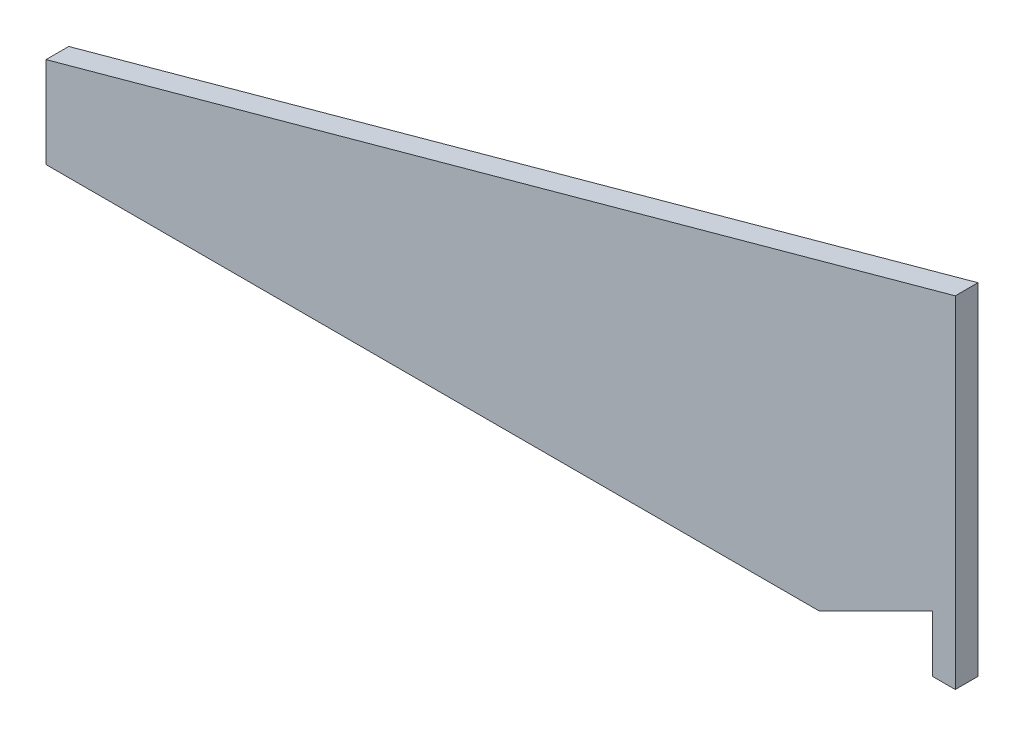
ISO-10303-21;
HEADER;
FILE_DESCRIPTION(('STEP AP214'),'2;1');
FILE_NAME('part.step','',(''),(''),'','','');
FILE_SCHEMA(('AUTOMOTIVE_DESIGN { 1 0 10303 214 1 1 1 1 }'));
ENDSEC;
DATA;
#1=APPLICATION_CONTEXT('core data for automotive mechanical design processes');
#2=APPLICATION_PROTOCOL_DEFINITION('international standard','automotive_design',2000,#1);
#3=PRODUCT_CONTEXT('',#1,'mechanical');
#4=PRODUCT('Part','Part','',(#3));
#5=PRODUCT_RELATED_PRODUCT_CATEGORY('part','',(#4));
#6=PRODUCT_DEFINITION_FORMATION('','',#4);
#7=PRODUCT_DEFINITION_CONTEXT('part definition',#1,'design');
#8=PRODUCT_DEFINITION('design','',#6,#7);
#9=PRODUCT_DEFINITION_SHAPE('','',#8);
#10=(LENGTH_UNIT() NAMED_UNIT(*) SI_UNIT(.MILLI.,.METRE.));
#11=(NAMED_UNIT(*) PLANE_ANGLE_UNIT() SI_UNIT($,.RADIAN.));
#12=(NAMED_UNIT(*) SI_UNIT($,.STERADIAN.) SOLID_ANGLE_UNIT());
#13=UNCERTAINTY_MEASURE_WITH_UNIT(LENGTH_MEASURE(1.E-05),#10,'distance_accuracy_value','');
#14=(GEOMETRIC_REPRESENTATION_CONTEXT(3) GLOBAL_UNCERTAINTY_ASSIGNED_CONTEXT((#13)) GLOBAL_UNIT_ASSIGNED_CONTEXT((#10,
#11,#12)) REPRESENTATION_CONTEXT('',''));
#15=CARTESIAN_POINT('',(0.,0.,0.));
#16=DIRECTION('',(0.,0.,1.));
#17=DIRECTION('',(1.,0.,0.));
#18=AXIS2_PLACEMENT_3D('',#15,#16,#17);
#19=CARTESIAN_POINT('',(7.29789674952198,-14.595793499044,2.));
#20=DIRECTION('',(-0.447213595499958,0.894427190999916,0.));
#21=DIRECTION('',(-0.894427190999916,-0.447213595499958,0.));
#22=AXIS2_PLACEMENT_3D('',#19,#20,#21);
#23=PLANE('',#22);
#24=DIRECTION('',(0.894427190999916,0.447213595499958,0.));
#25=VECTOR('',#24,1.);
#26=CARTESIAN_POINT('',(7.29789674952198,-14.595793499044,0.));
#27=LINE('',#26,#25);
#28=CARTESIAN_POINT('',(36.4894837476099,0.,0.));
#29=VERTEX_POINT('',#28);
#30=CARTESIAN_POINT('',(46.4894837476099,5.,0.));
#31=VERTEX_POINT('',#30);
#32=EDGE_CURVE('E135',#29,#31,#27,.T.);
#33=ORIENTED_EDGE('',*,*,#32,.T.);
#34=DIRECTION('',(0.,0.,-1.));
#35=VECTOR('',#34,1.);
#36=CARTESIAN_POINT('',(46.4894837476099,5.,2.));
#37=LINE('',#36,#35);
#38=CARTESIAN_POINT('',(46.4894837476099,5.,2.));
#39=VERTEX_POINT('',#38);
#40=EDGE_CURVE('E11',#39,#31,#37,.T.);
#41=ORIENTED_EDGE('',*,*,#40,.F.);
#42=DIRECTION('',(0.894427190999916,0.447213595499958,0.));
#43=VECTOR('',#42,1.);
#44=CARTESIAN_POINT('',(7.29789674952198,-14.595793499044,2.));
#45=LINE('',#44,#43);
#46=CARTESIAN_POINT('',(36.4894837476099,0.,2.));
#47=VERTEX_POINT('',#46);
#48=EDGE_CURVE('E181',#47,#39,#45,.T.);
#49=ORIENTED_EDGE('',*,*,#48,.F.);
#50=DIRECTION('',(0.,0.,-1.));
#51=VECTOR('',#50,1.);
#52=CARTESIAN_POINT('',(36.4894837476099,0.,2.));
#53=LINE('',#52,#51);
#54=EDGE_CURVE('E130',#47,#29,#53,.T.);
#55=ORIENTED_EDGE('',*,*,#54,.T.);
#56=EDGE_LOOP('',(#33,#41,#49,#55));
#57=FACE_BOUND('',#56,.T.);
#58=ADVANCED_FACE('F41',(#57),#23,.F.);
#59=CARTESIAN_POINT('',(46.4894837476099,0.,2.));
#60=DIRECTION('',(1.,0.,0.));
#61=DIRECTION('',(0.,1.,0.));
#62=AXIS2_PLACEMENT_3D('',#59,#60,#61);
#63=PLANE('',#62);
#64=DIRECTION('',(0.,-1.,0.));
#65=VECTOR('',#64,1.);
#66=CARTESIAN_POINT('',(46.4894837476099,0.,0.));
#67=LINE('',#66,#65);
#68=CARTESIAN_POINT('',(46.4894837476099,0.,0.));
#69=VERTEX_POINT('',#68);
#70=EDGE_CURVE('E139',#31,#69,#67,.T.);
#71=ORIENTED_EDGE('',*,*,#70,.T.);
#72=DIRECTION('',(0.,0.,-1.));
#73=VECTOR('',#72,1.);
#74=CARTESIAN_POINT('',(46.4894837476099,0.,2.));
#75=LINE('',#74,#73);
#76=CARTESIAN_POINT('',(46.4894837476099,0.,2.));
#77=VERTEX_POINT('',#76);
#78=EDGE_CURVE('E50',#77,#69,#75,.T.);
#79=ORIENTED_EDGE('',*,*,#78,.F.);
#80=DIRECTION('',(0.,-1.,0.));
#81=VECTOR('',#80,1.);
#82=CARTESIAN_POINT('',(46.4894837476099,0.,2.));
#83=LINE('',#82,#81);
#84=EDGE_CURVE('E94',#39,#77,#83,.T.);
#85=ORIENTED_EDGE('',*,*,#84,.F.);
#86=ORIENTED_EDGE('',*,*,#40,.T.);
#87=EDGE_LOOP('',(#71,#79,#85,#86));
#88=FACE_BOUND('',#87,.T.);
#89=ADVANCED_FACE('F187',(#88),#63,.F.);
#90=CARTESIAN_POINT('',(0.,0.,2.));
#91=DIRECTION('',(0.,1.,0.));
#92=DIRECTION('',(0.,0.,1.));
#93=AXIS2_PLACEMENT_3D('',#90,#91,#92);
#94=PLANE('',#93);
#95=DIRECTION('',(1.,0.,0.));
#96=VECTOR('',#95,1.);
#97=CARTESIAN_POINT('',(0.,0.,0.));
#98=LINE('',#97,#96);
#99=CARTESIAN_POINT('',(48.48948374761,0.,0.));
#100=VERTEX_POINT('',#99);
#101=EDGE_CURVE('E142',#69,#100,#98,.T.);
#102=ORIENTED_EDGE('',*,*,#101,.T.);
#103=DIRECTION('',(0.,0.,-1.));
#104=VECTOR('',#103,1.);
#105=CARTESIAN_POINT('',(48.48948374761,0.,2.));
#106=LINE('',#105,#104);
#107=CARTESIAN_POINT('',(48.48948374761,0.,2.));
#108=VERTEX_POINT('',#107);
#109=EDGE_CURVE('E161',#108,#100,#106,.T.);
#110=ORIENTED_EDGE('',*,*,#109,.F.);
#111=DIRECTION('',(1.,0.,0.));
#112=VECTOR('',#111,1.);
#113=CARTESIAN_POINT('',(0.,0.,2.));
#114=LINE('',#113,#112);
#115=EDGE_CURVE('E132',#77,#108,#114,.T.);
#116=ORIENTED_EDGE('',*,*,#115,.F.);
#117=ORIENTED_EDGE('',*,*,#78,.T.);
#118=EDGE_LOOP('',(#102,#110,#116,#117));
#119=FACE_BOUND('',#118,.T.);
#120=ADVANCED_FACE('F168',(#119),#94,.F.);
#121=CARTESIAN_POINT('',(48.48948374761,0.,2.));
#122=DIRECTION('',(1.,0.,0.));
#123=DIRECTION('',(0.,1.,0.));
#124=AXIS2_PLACEMENT_3D('',#121,#122,#123);
#125=PLANE('',#124);
#126=DIRECTION('',(0.,-1.,0.));
#127=VECTOR('',#126,1.);
#128=CARTESIAN_POINT('',(48.48948374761,0.,0.));
#129=LINE('',#128,#127);
#130=CARTESIAN_POINT('',(48.4894837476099,30.,0.));
#131=VERTEX_POINT('',#130);
#132=EDGE_CURVE('E146',#131,#100,#129,.T.);
#133=ORIENTED_EDGE('',*,*,#132,.F.);
#134=DIRECTION('',(0.,0.,-1.));
#135=VECTOR('',#134,1.);
#136=CARTESIAN_POINT('',(48.4894837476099,30.,2.));
#137=LINE('',#136,#135);
#138=CARTESIAN_POINT('',(48.4894837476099,30.,2.));
#139=VERTEX_POINT('',#138);
#140=EDGE_CURVE('E117',#139,#131,#137,.T.);
#141=ORIENTED_EDGE('',*,*,#140,.F.);
#142=DIRECTION('',(0.,-1.,0.));
#143=VECTOR('',#142,1.);
#144=CARTESIAN_POINT('',(48.48948374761,0.,2.));
#145=LINE('',#144,#143);
#146=EDGE_CURVE('E123',#139,#108,#145,.T.);
#147=ORIENTED_EDGE('',*,*,#146,.T.);
#148=ORIENTED_EDGE('',*,*,#109,.T.);
#149=EDGE_LOOP('',(#133,#141,#147,#148));
#150=FACE_BOUND('',#149,.T.);
#151=ADVANCED_FACE('F175',(#150),#125,.T.);
#152=CARTESIAN_POINT('',(-4.26076261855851,15.4936822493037,2.));
#153=DIRECTION('',(-0.265156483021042,0.96420539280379,0.));
#154=DIRECTION('',(-0.96420539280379,-0.265156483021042,0.));
#155=AXIS2_PLACEMENT_3D('',#152,#153,#154);
#156=PLANE('',#155);
#157=DIRECTION('',(0.96420539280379,0.265156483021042,0.));
#158=VECTOR('',#157,1.);
#159=CARTESIAN_POINT('',(-4.26076261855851,15.4936822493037,0.));
#160=LINE('',#159,#158);
#161=CARTESIAN_POINT('',(-31.5105162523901,8.,0.));
#162=VERTEX_POINT('',#161);
#163=EDGE_CURVE('E111',#162,#131,#160,.T.);
#164=ORIENTED_EDGE('',*,*,#163,.F.);
#165=DIRECTION('',(0.,0.,-1.));
#166=VECTOR('',#165,1.);
#167=CARTESIAN_POINT('',(-31.5105162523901,8.,2.));
#168=LINE('',#167,#166);
#169=CARTESIAN_POINT('',(-31.5105162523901,8.,2.));
#170=VERTEX_POINT('',#169);
#171=EDGE_CURVE('E106',#170,#162,#168,.T.);
#172=ORIENTED_EDGE('',*,*,#171,.F.);
#173=DIRECTION('',(0.96420539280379,0.265156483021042,0.));
#174=VECTOR('',#173,1.);
#175=CARTESIAN_POINT('',(-4.26076261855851,15.4936822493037,2.));
#176=LINE('',#175,#174);
#177=EDGE_CURVE('E109',#170,#139,#176,.T.);
#178=ORIENTED_EDGE('',*,*,#177,.T.);
#179=ORIENTED_EDGE('',*,*,#140,.T.);
#180=EDGE_LOOP('',(#164,#172,#178,#179));
#181=FACE_BOUND('',#180,.T.);
#182=ADVANCED_FACE('F108',(#181),#156,.T.);
#183=CARTESIAN_POINT('',(-31.5105162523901,0.,2.));
#184=DIRECTION('',(-1.,0.,0.));
#185=DIRECTION('',(0.,0.,1.));
#186=AXIS2_PLACEMENT_3D('',#183,#184,#185);
#187=PLANE('',#186);
#188=DIRECTION('',(0.,1.,0.));
#189=VECTOR('',#188,1.);
#190=CARTESIAN_POINT('',(-31.5105162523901,0.,0.));
#191=LINE('',#190,#189);
#192=CARTESIAN_POINT('',(-31.5105162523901,0.,0.));
#193=VERTEX_POINT('',#192);
#194=EDGE_CURVE('E152',#193,#162,#191,.T.);
#195=ORIENTED_EDGE('',*,*,#194,.F.);
#196=DIRECTION('',(0.,0.,-1.));
#197=VECTOR('',#196,1.);
#198=CARTESIAN_POINT('',(-31.5105162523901,0.,2.));
#199=LINE('',#198,#197);
#200=CARTESIAN_POINT('',(-31.5105162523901,0.,2.));
#201=VERTEX_POINT('',#200);
#202=EDGE_CURVE('E83',#201,#193,#199,.T.);
#203=ORIENTED_EDGE('',*,*,#202,.F.);
#204=DIRECTION('',(0.,1.,0.));
#205=VECTOR('',#204,1.);
#206=CARTESIAN_POINT('',(-31.5105162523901,0.,2.));
#207=LINE('',#206,#205);
#208=EDGE_CURVE('E121',#201,#170,#207,.T.);
#209=ORIENTED_EDGE('',*,*,#208,.T.);
#210=ORIENTED_EDGE('',*,*,#171,.T.);
#211=EDGE_LOOP('',(#195,#203,#209,#210));
#212=FACE_BOUND('',#211,.T.);
#213=ADVANCED_FACE('F126',(#212),#187,.T.);
#214=EDGE_CURVE('E86',#193,#29,#98,.T.);
#215=ORIENTED_EDGE('',*,*,#214,.T.);
#216=ORIENTED_EDGE('',*,*,#54,.F.);
#217=EDGE_CURVE('E58',#201,#47,#114,.T.);
#218=ORIENTED_EDGE('',*,*,#217,.F.);
#219=ORIENTED_EDGE('',*,*,#202,.T.);
#220=EDGE_LOOP('',(#215,#216,#218,#219));
#221=FACE_BOUND('',#220,.T.);
#222=ADVANCED_FACE('F194',(#221),#94,.F.);
#223=CARTESIAN_POINT('',(0.,0.,2.));
#224=DIRECTION('',(0.,0.,1.));
#225=DIRECTION('',(1.,0.,0.));
#226=AXIS2_PLACEMENT_3D('',#223,#224,#225);
#227=PLANE('',#226);
#228=ORIENTED_EDGE('',*,*,#48,.T.);
#229=ORIENTED_EDGE('',*,*,#84,.T.);
#230=ORIENTED_EDGE('',*,*,#115,.T.);
#231=ORIENTED_EDGE('',*,*,#146,.F.);
#232=ORIENTED_EDGE('',*,*,#177,.F.);
#233=ORIENTED_EDGE('',*,*,#208,.F.);
#234=ORIENTED_EDGE('',*,*,#217,.T.);
#235=EDGE_LOOP('',(#228,#229,#230,#231,#232,#233,#234));
#236=FACE_BOUND('',#235,.T.);
#237=ADVANCED_FACE('F120',(#236),#227,.T.);
#238=CARTESIAN_POINT('',(0.,0.,0.));
#239=DIRECTION('',(0.,0.,1.));
#240=DIRECTION('',(1.,0.,0.));
#241=AXIS2_PLACEMENT_3D('',#238,#239,#240);
#242=PLANE('',#241);
#243=ORIENTED_EDGE('',*,*,#32,.F.);
#244=ORIENTED_EDGE('',*,*,#214,.F.);
#245=ORIENTED_EDGE('',*,*,#194,.T.);
#246=ORIENTED_EDGE('',*,*,#163,.T.);
#247=ORIENTED_EDGE('',*,*,#132,.T.);
#248=ORIENTED_EDGE('',*,*,#101,.F.);
#249=ORIENTED_EDGE('',*,*,#70,.F.);
#250=EDGE_LOOP('',(#243,#244,#245,#246,#247,#248,#249));
#251=FACE_BOUND('',#250,.T.);
#252=ADVANCED_FACE('F172',(#251),#242,.F.);
#253=CLOSED_SHELL('',(#58,#89,#120,#151,#182,#213,#222,#237,#252));
#254=MANIFOLD_SOLID_BREP('B2',#253);
#255=ADVANCED_BREP_SHAPE_REPRESENTATION('',(#18,#254),#14);
#256=SHAPE_DEFINITION_REPRESENTATION(#9,#255);
ENDSEC;
END-ISO-10303-21;
